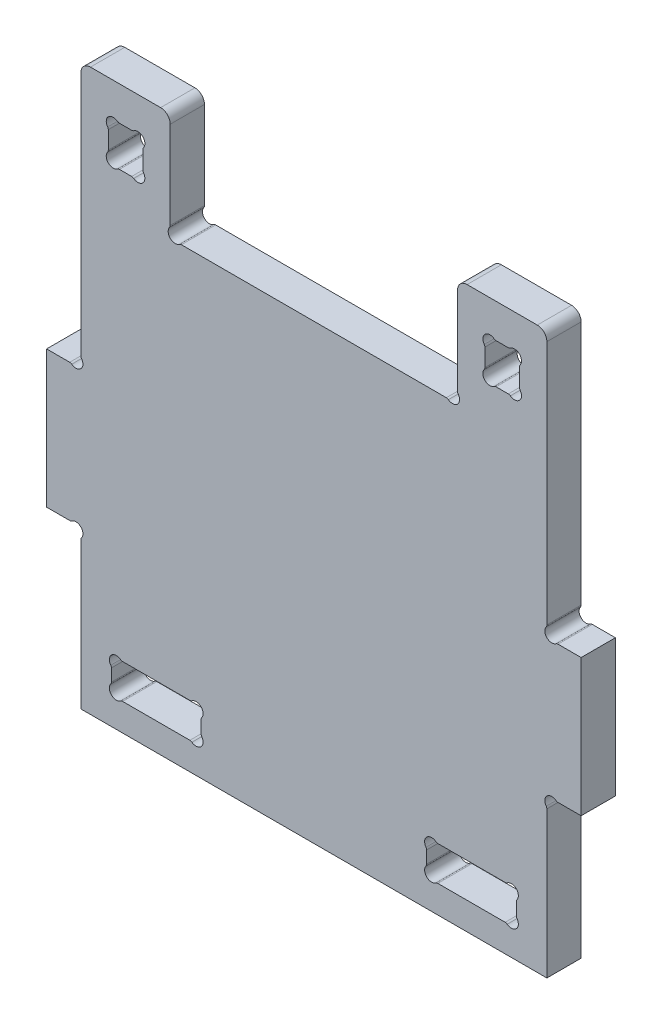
from build123d import *

# Parameters (mm, degrees)
BOSS_EXTRU_2_DEPTH = 25
CONG_1_R           = 7


with BuildPart() as part:
    # Esquisse2 → Boss.-Extru.2 (new body)
    with BuildSketch(Plane.XY):
        with BuildLine():
            Line((0, 0), (-170, 0))
            Line((-170, 0), (-170, 106.868959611))
            ThreePointArc((-170, 106.868959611), (-169.873982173, 107.652674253), (-169.508633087, 108.357379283))
            ThreePointArc((-169.508633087, 108.357379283), (-170, 115), (-176.642620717, 115.491366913))
            ThreePointArc((-176.642620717, 115.491366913), (-177.347325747, 115.126017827), (-178.131040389, 115))
            Line((-178.131040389, 115), (-195, 115))
            Line((-195, 115), (-195, 215))
            Line((-195, 215), (-178.131040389, 215))
            ThreePointArc((-178.131040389, 215), (-177.347325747, 214.873982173), (-176.642620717, 214.508633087))
            ThreePointArc((-176.642620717, 214.508633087), (-170, 215), (-169.508633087, 221.642620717))
            ThreePointArc((-169.508633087, 221.642620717), (-169.873982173, 222.347325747), (-170, 223.131040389))
            Line((-170, 223.131040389), (-170, 409.066666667))
            Line((-170, 409.066666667), (-104.8, 409.066666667))
            Line((-104.8, 409.066666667), (-104.8, 338.131040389))
            ThreePointArc((-104.8, 338.131040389), (-104.926017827, 337.347325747), (-105.291366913, 336.642620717))
            ThreePointArc((-105.291366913, 336.642620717), (-104.8, 330), (-98.157379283, 329.508633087))
            ThreePointArc((-98.157379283, 329.508633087), (-97.452674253, 329.873982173), (-96.668959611, 330))
            Line((-96.668959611, 330), (0, 330))
            Line((0, 330), (0, 0))
        make_face()
        with BuildLine():
            Line((-141.868959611, 384.166666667), (-132.931040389, 384.166666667))
            ThreePointArc((-132.931040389, 384.166666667), (-132.147325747, 384.292684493), (-131.442620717, 384.65803358))
            ThreePointArc((-131.442620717, 384.65803358), (-124.8, 384.166666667), (-124.308633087, 377.52404595))
            ThreePointArc((-124.308633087, 377.52404595), (-124.673982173, 376.81934092), (-124.8, 376.035626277))
            Line((-124.8, 376.035626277), (-124.8, 363.131040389))
            ThreePointArc((-124.8, 363.131040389), (-124.673982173, 362.347325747), (-124.308633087, 361.642620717))
            ThreePointArc((-124.308633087, 361.642620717), (-124.8, 355), (-131.442620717, 354.508633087))
            ThreePointArc((-131.442620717, 354.508633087), (-132.147325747, 354.873982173), (-132.931040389, 355))
            Line((-132.931040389, 355), (-141.868959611, 355))
            ThreePointArc((-141.868959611, 355), (-142.652674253, 354.873982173), (-143.357379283, 354.508633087))
            ThreePointArc((-143.357379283, 354.508633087), (-150, 355), (-150.491366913, 361.642620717))
            ThreePointArc((-150.491366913, 361.642620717), (-150.126017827, 362.347325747), (-150, 363.131040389))
            Line((-150, 363.131040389), (-150, 376.035626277))
            ThreePointArc((-150, 376.035626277), (-150.126017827, 376.81934092), (-150.491366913, 377.52404595))
            ThreePointArc((-150.491366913, 377.52404595), (-150, 384.166666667), (-143.357379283, 384.65803358))
            ThreePointArc((-143.357379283, 384.65803358), (-142.652674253, 384.292684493), (-141.868959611, 384.166666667))
        make_face(mode=Mode.SUBTRACT)
        with BuildLine():
            Line((-139.568959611, 45.2), (-90.431040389, 45.2))
            ThreePointArc((-90.431040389, 45.2), (-89.647325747, 45.326017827), (-88.942620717, 45.691366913))
            ThreePointArc((-88.942620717, 45.691366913), (-82.3, 45.2), (-81.808633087, 38.557379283))
            ThreePointArc((-81.808633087, 38.557379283), (-82.173982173, 37.852674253), (-82.3, 37.068959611))
            Line((-82.3, 37.068959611), (-82.3, 28.131040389))
            ThreePointArc((-82.3, 28.131040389), (-82.173982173, 27.347325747), (-81.808633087, 26.642620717))
            ThreePointArc((-81.808633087, 26.642620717), (-82.3, 20), (-88.942620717, 19.508633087))
            ThreePointArc((-88.942620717, 19.508633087), (-89.647325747, 19.873982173), (-90.431040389, 20))
            Line((-90.431040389, 20), (-139.568959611, 20))
            ThreePointArc((-139.568959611, 20), (-140.352674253, 19.873982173), (-141.057379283, 19.508633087))
            ThreePointArc((-141.057379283, 19.508633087), (-147.7, 20), (-148.191366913, 26.642620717))
            ThreePointArc((-148.191366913, 26.642620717), (-147.826017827, 27.347325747), (-147.7, 28.131040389))
            Line((-147.7, 28.131040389), (-147.7, 37.068959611))
            ThreePointArc((-147.7, 37.068959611), (-147.826017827, 37.852674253), (-148.191366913, 38.557379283))
            ThreePointArc((-148.191366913, 38.557379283), (-147.7, 45.2), (-141.057379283, 45.691366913))
            ThreePointArc((-141.057379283, 45.691366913), (-140.352674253, 45.326017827), (-139.568959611, 45.2))
        make_face(mode=Mode.SUBTRACT)
    extrude(amount=BOSS_EXTRU_2_DEPTH)

    # Cong_1
    cong_1_edges = [part.edges().sort_by_distance(p)[0] for p in [
        (-170, 409.066666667, 12.5),
        (-104.8, 409.066666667, 12.5),
    ]]
    fillet(cong_1_edges, radius=CONG_1_R)

    # Mirror1: part across plane


with BuildPart() as part_1:
    add(part.part)
    add(part.part.mirror(Plane(origin=(0, 330, 25), x_dir=(0, 0, 1), z_dir=(-1, 0, 0))))


solid = part_1.part
